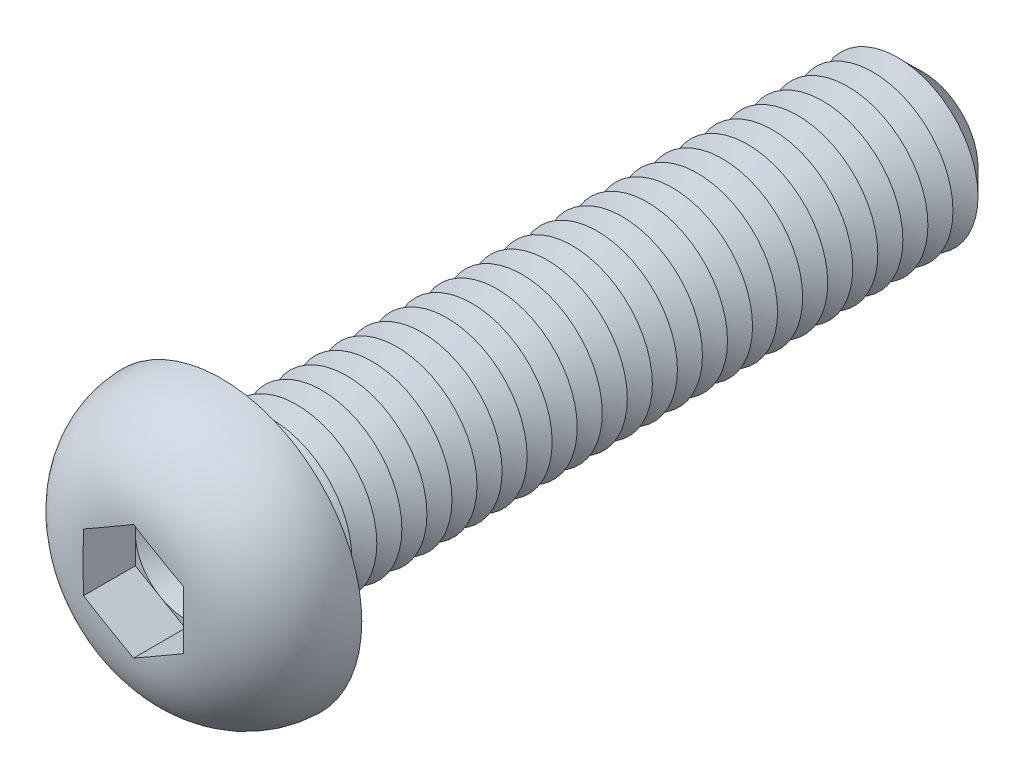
from build123d import *

# Parameters (mm, degrees)
CUT_EXTRUDE1_DEPTH  = 2.6
SKETCH4_R           = 4
BOSS_EXTRUDE1_DEPTH = 35
CHAMFER1_SIZE       = 1.25
LPATTERN1_COUNT     = 26
LPATTERN1_PITCH     = 1.25
FILLET2_R           = 0.5


with BuildPart() as part:
    # Sketch2 → Revolve1 (revolve)
    with BuildSketch(Plane(origin=(0, 0, 0), x_dir=(0, 0, -1), z_dir=(1, 0, 0)), mode=Mode.PRIVATE) as revolve1_sk:
        with BuildLine():
            Line((0, 0), (-4.4, 0))
            Line((-4.4, 0), (-4.4, 2.501111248))
            ThreePointArc((-4.4, 2.501111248), (-3.117141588, 5.647537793), (0, 7))
            Line((0, 7), (0, 0))
        make_face()
    revolve(revolve1_sk.sketch.rotate(Axis((0, 0, 47.934239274), (0, 0, -1)), 90), axis=Axis((0, 0, 47.934239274), (0, 0, -1)))

    # Sketch3 → Cut-Extrude1 (cut)
    with BuildSketch(Plane.XY.offset(4.4)):
        Polygon((0, 2.886751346), (-2.5, 1.443375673), (-2.5, -1.443375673), (0, -2.886751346), (2.5, -1.443375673), (2.5, 1.443375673), align=None)
    extrude(amount=-CUT_EXTRUDE1_DEPTH, mode=Mode.SUBTRACT)

    # Sketch4 → Boss-Extrude1 (add)
    with BuildSketch(Plane(origin=(0, 0, 0), x_dir=(-1, 0, 0), z_dir=(0, 0, -1))):
        with Locations(Location((0, 0, 0), (0, 0, 180))):
            Circle(SKETCH4_R)
    extrude(amount=BOSS_EXTRUDE1_DEPTH)

    # Chamfer1
    chamfer1_edges = [part.edges().sort_by_distance(p)[0] for p in [
        (-4, 0, -35),
    ]]
    chamfer(chamfer1_edges, length=CHAMFER1_SIZE)

    # Sketch5 → Cut-Revolve1 (revolve, cut)
    with BuildSketch(Plane(origin=(0, 0, 0), x_dir=(0, 0, -1), z_dir=(1, 0, 0)), mode=Mode.PRIVATE) as cut_revolve1_sk:
        Polygon((1.25, 4), (2.5, 4), (1.875, 2.917468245), align=None)
    cut_revolve1 = revolve(cut_revolve1_sk.sketch.rotate(Axis((0, 0, 47.934239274), (0, 0, -1)), 90), axis=Axis((0, 0, 47.934239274), (0, 0, -1)), mode=Mode.SUBTRACT)

    # LPattern1: Cut-Revolve1 ×26
    with Locations(*[(0, 0, -i * LPATTERN1_PITCH) for i in range(1, LPATTERN1_COUNT)]):
        add(cut_revolve1, mode=Mode.SUBTRACT)

    # Fillet2
    fillet2_edges = [part.edges().sort_by_distance(p)[0] for p in [
        (-4, 0, 0),
    ]]
    fillet(fillet2_edges, radius=FILLET2_R)

    # Cut-Extrude2 cone 1 section (on through the dimple's axis) → Cut-Extrude2 (revolve, cut)
    with BuildSketch(Plane(origin=(0, 0, 1.8), x_dir=(0, -1, 0), z_dir=(1, 0, 0))):
        Polygon((0, 0), (2.5, 0), (0, 1.443375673), align=None)
    revolve(axis=Axis((0, 0, 1.8), (0, 0, -1)), mode=Mode.SUBTRACT)


solid = part.part
